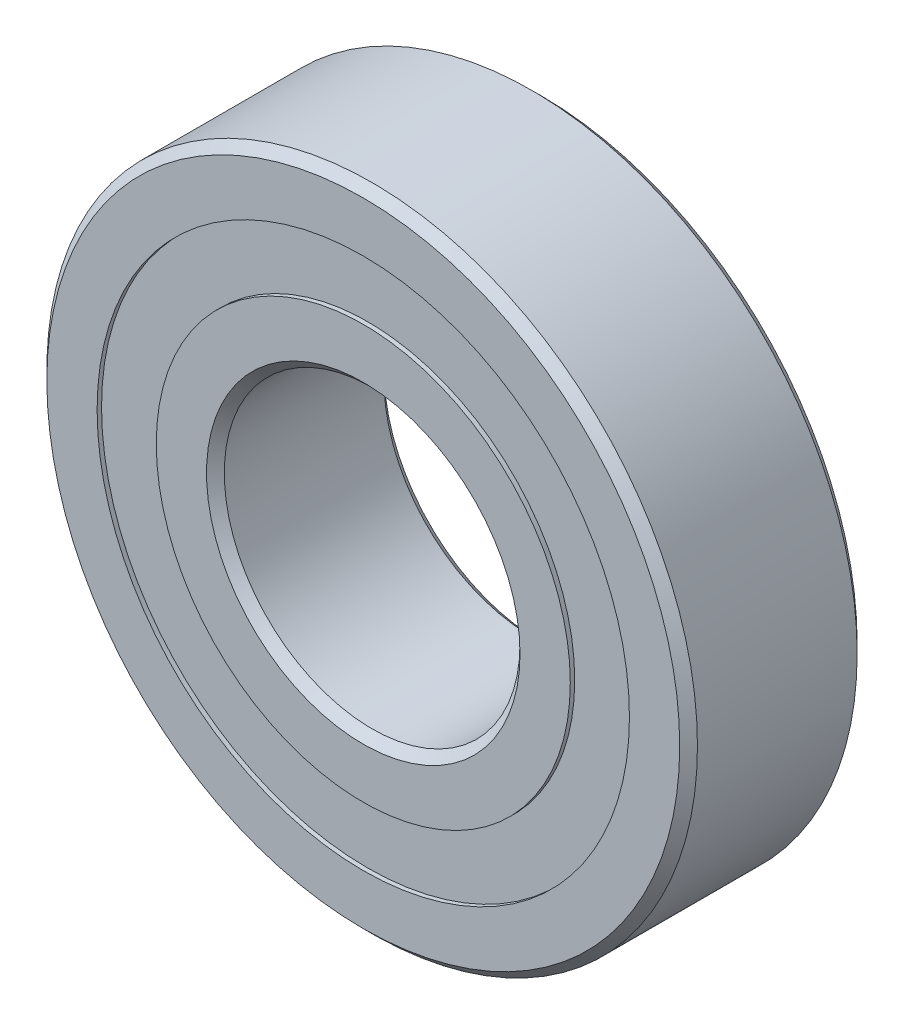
from build123d import *

# Parameters (mm, degrees)
CIRPATTERN1_COUNT = 10
SKETCH5_W         = 1.183333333
SKETCH5_H         = 2


with BuildPart() as part:
    # Sketch3 → Revolve1 (revolve)
    with BuildSketch(Plane(origin=(0, 0, 0), x_dir=(0, 0, -1), z_dir=(1, 0, 0)), mode=Mode.PRIVATE) as revolve1_sk:
        with BuildLine():
            Line((-3, 10.7), (-3, 9))
            Line((-3, 9), (-1.333333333, 9))
            ThreePointArc((-1.333333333, 9), (0, 9.666666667), (1.333333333, 9))
            Line((1.333333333, 9), (3, 9))
            Line((3, 9), (3, 10.7))
            Line((3, 10.7), (2.7, 11))
            Line((2.7, 11), (-2.7, 11))
            Line((-2.7, 11), (-3, 10.7))
        make_face()
        with BuildLine():
            Line((-3, 5.3), (-3, 7))
            Line((-3, 7), (-1.333333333, 7))
            ThreePointArc((-1.333333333, 7), (0, 6.333333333), (1.333333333, 7))
            Line((1.333333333, 7), (3, 7))
            Line((3, 7), (3, 5.3))
            Line((3, 5.3), (2.7, 5))
            Line((2.7, 5), (-2.7, 5))
            Line((-2.7, 5), (-3, 5.3))
        make_face()
    revolve(revolve1_sk.sketch.rotate(Axis((0, 0, 3), (0, 0, -1)), 90), axis=Axis((0, 0, 3), (0, 0, -1)))


with BuildPart() as body_2:
    # Sketch4 → Revolve2 (revolve)
    with BuildSketch(Plane(origin=(0, 0, 0), x_dir=(0, 0, -1), z_dir=(1, 0, 0))):
        with BuildLine():
            Line((-1.666666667, 8), (1.666666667, 8))
            ThreePointArc((1.666666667, 8), (0, 9.666666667), (-1.666666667, 8))
        make_face()
    revolve(axis=Axis((0, 8, 1.666666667), (0, 0, -1)))


with BuildPart() as cirpattern1_1:
    # CirPattern1: pattern copy
    add(body_2.part.rotate(Axis((0, 0, 0), (0, 0, 1)), 1 * 360 / CIRPATTERN1_COUNT))


with BuildPart() as cirpattern1_2:
    # CirPattern1: pattern copy
    add(body_2.part.rotate(Axis((0, 0, 0), (0, 0, 1)), 2 * 360 / CIRPATTERN1_COUNT))


with BuildPart() as cirpattern1_3:
    # CirPattern1: pattern copy
    add(body_2.part.rotate(Axis((0, 0, 0), (0, 0, 1)), 3 * 360 / CIRPATTERN1_COUNT))


with BuildPart() as cirpattern1_4:
    # CirPattern1: pattern copy
    add(body_2.part.rotate(Axis((0, 0, 0), (0, 0, 1)), 4 * 360 / CIRPATTERN1_COUNT))


with BuildPart() as cirpattern1_5:
    # CirPattern1: pattern copy
    add(body_2.part.rotate(Axis((0, 0, 0), (0, 0, 1)), 5 * 360 / CIRPATTERN1_COUNT))


with BuildPart() as cirpattern1_6:
    # CirPattern1: pattern copy
    add(body_2.part.rotate(Axis((0, 0, 0), (0, 0, 1)), 6 * 360 / CIRPATTERN1_COUNT))


with BuildPart() as cirpattern1_7:
    # CirPattern1: pattern copy
    add(body_2.part.rotate(Axis((0, 0, 0), (0, 0, 1)), 7 * 360 / CIRPATTERN1_COUNT))


with BuildPart() as cirpattern1_8:
    # CirPattern1: pattern copy
    add(body_2.part.rotate(Axis((0, 0, 0), (0, 0, 1)), 8 * 360 / CIRPATTERN1_COUNT))


with BuildPart() as cirpattern1_9:
    # CirPattern1: pattern copy
    add(body_2.part.rotate(Axis((0, 0, 0), (0, 0, 1)), 9 * 360 / CIRPATTERN1_COUNT))


with BuildPart() as body_12:
    # Sketch5 → Revolve3 (revolve)
    with BuildSketch(Plane(origin=(0, 0, 0), x_dir=(0, 0, -1), z_dir=(1, 0, 0)), mode=Mode.PRIVATE) as revolve3_sk:
        with Locations((-2.258333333, 8)):
            Rectangle(SKETCH5_W, SKETCH5_H)
        with Locations((2.258333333, 8)):
            Rectangle(SKETCH5_W, SKETCH5_H)
    revolve(revolve3_sk.sketch.rotate(Axis((0, 0, 3), (0, 0, -1)), 90), axis=Axis((0, 0, 3), (0, 0, -1)))


solid = Compound([part.part, body_2.part, cirpattern1_1.part, cirpattern1_2.part, cirpattern1_3.part, cirpattern1_4.part, cirpattern1_5.part, cirpattern1_6.part, cirpattern1_7.part, cirpattern1_8.part, cirpattern1_9.part, body_12.part])
